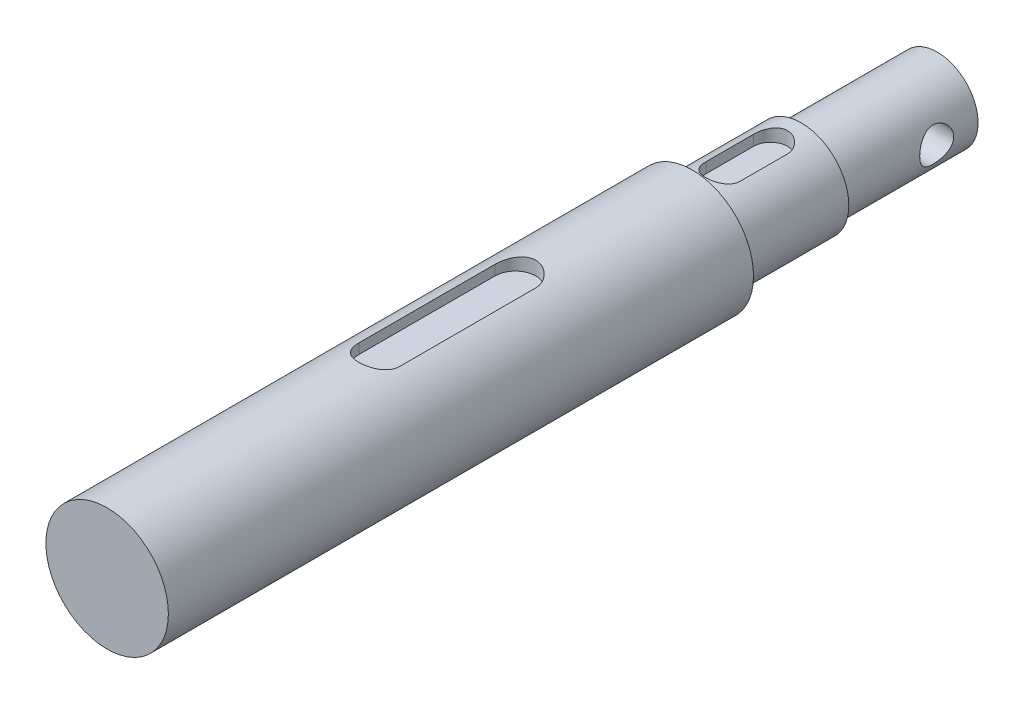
ISO-10303-21;
HEADER;
FILE_DESCRIPTION(('STEP AP214'),'2;1');
FILE_NAME('part.step','',(''),(''),'','','');
FILE_SCHEMA(('AUTOMOTIVE_DESIGN { 1 0 10303 214 1 1 1 1 }'));
ENDSEC;
DATA;
#1=APPLICATION_CONTEXT('core data for automotive mechanical design processes');
#2=APPLICATION_PROTOCOL_DEFINITION('international standard','automotive_design',2000,#1);
#3=PRODUCT_CONTEXT('',#1,'mechanical');
#4=PRODUCT('Part','Part','',(#3));
#5=PRODUCT_RELATED_PRODUCT_CATEGORY('part','',(#4));
#6=PRODUCT_DEFINITION_FORMATION('','',#4);
#7=PRODUCT_DEFINITION_CONTEXT('part definition',#1,'design');
#8=PRODUCT_DEFINITION('design','',#6,#7);
#9=PRODUCT_DEFINITION_SHAPE('','',#8);
#10=(LENGTH_UNIT() NAMED_UNIT(*) SI_UNIT(.MILLI.,.METRE.));
#11=(NAMED_UNIT(*) PLANE_ANGLE_UNIT() SI_UNIT($,.RADIAN.));
#12=(NAMED_UNIT(*) SI_UNIT($,.STERADIAN.) SOLID_ANGLE_UNIT());
#13=UNCERTAINTY_MEASURE_WITH_UNIT(LENGTH_MEASURE(1.E-05),#10,'distance_accuracy_value','');
#14=(GEOMETRIC_REPRESENTATION_CONTEXT(3) GLOBAL_UNCERTAINTY_ASSIGNED_CONTEXT((#13)) GLOBAL_UNIT_ASSIGNED_CONTEXT((#10,
#11,#12)) REPRESENTATION_CONTEXT('',''));
#15=CARTESIAN_POINT('',(0.,0.,0.));
#16=DIRECTION('',(0.,0.,1.));
#17=DIRECTION('',(1.,0.,0.));
#18=AXIS2_PLACEMENT_3D('',#15,#16,#17);
#19=CARTESIAN_POINT('',(-4.5,0.,-98.));
#20=DIRECTION('',(0.,0.,-1.));
#21=DIRECTION('',(-1.,0.,0.));
#22=AXIS2_PLACEMENT_3D('',#19,#20,#21);
#23=PLANE('',#22);
#24=CARTESIAN_POINT('',(-4.5,0.,-98.));
#25=DIRECTION('',(0.,0.,-1.));
#26=DIRECTION('',(-1.,0.,0.));
#27=AXIS2_PLACEMENT_3D('',#24,#25,#26);
#28=CIRCLE('',#27,7.);
#29=CARTESIAN_POINT('',(-11.5,0.,-98.));
#30=VERTEX_POINT('',#29);
#31=EDGE_CURVE('E158',#30,#30,#28,.T.);
#32=ORIENTED_EDGE('',*,*,#31,.T.);
#33=EDGE_LOOP('',(#32));
#34=FACE_BOUND('',#33,.T.);
#35=CARTESIAN_POINT('',(-4.5,0.,-98.));
#36=DIRECTION('',(0.,0.,-1.));
#37=DIRECTION('',(-1.,0.,0.));
#38=AXIS2_PLACEMENT_3D('',#35,#36,#37);
#39=CIRCLE('',#38,6.);
#40=CARTESIAN_POINT('',(-10.5,0.,-98.));
#41=VERTEX_POINT('',#40);
#42=EDGE_CURVE('E130',#41,#41,#39,.T.);
#43=ORIENTED_EDGE('',*,*,#42,.F.);
#44=EDGE_LOOP('',(#43));
#45=FACE_BOUND('',#44,.T.);
#46=ADVANCED_FACE('F31',(#34,#45),#23,.T.);
#47=CARTESIAN_POINT('',(-4.5,0.,-98.));
#48=DIRECTION('',(0.,0.,1.));
#49=DIRECTION('',(1.,0.,0.));
#50=AXIS2_PLACEMENT_3D('',#47,#48,#49);
#51=CYLINDRICAL_SURFACE('',#50,7.);
#52=CARTESIAN_POINT('',(-4.5,0.,-82.));
#53=DIRECTION('',(0.,0.,1.));
#54=DIRECTION('',(1.,0.,0.));
#55=AXIS2_PLACEMENT_3D('',#52,#53,#54);
#56=CIRCLE('',#55,7.);
#57=CARTESIAN_POINT('',(2.5,0.,-82.));
#58=VERTEX_POINT('',#57);
#59=EDGE_CURVE('E167',#58,#58,#56,.F.);
#60=ORIENTED_EDGE('',*,*,#59,.T.);
#61=EDGE_LOOP('',(#60));
#62=FACE_BOUND('',#61,.T.);
#63=ORIENTED_EDGE('',*,*,#31,.F.);
#64=EDGE_LOOP('',(#63));
#65=FACE_BOUND('',#64,.T.);
#66=CARTESIAN_POINT('',(-7.,6.53834841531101,-86.5));
#67=CARTESIAN_POINT('',(-7.00000932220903,6.53833653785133,-86.4321107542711));
#68=CARTESIAN_POINT('',(-6.99723485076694,6.53940549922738,-86.3642280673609));
#69=CARTESIAN_POINT('',(-6.9861910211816,6.54361657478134,-86.2289960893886));
#70=CARTESIAN_POINT('',(-6.97792334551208,6.54675805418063,-86.1616466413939));
#71=CARTESIAN_POINT('',(-6.95600175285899,6.55501217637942,-86.0281785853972));
#72=CARTESIAN_POINT('',(-6.94236559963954,6.56011831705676,-85.9620566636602));
#73=CARTESIAN_POINT('',(-6.90985115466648,6.57213177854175,-85.8312981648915));
#74=CARTESIAN_POINT('',(-6.89097263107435,6.57903917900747,-85.7666616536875));
#75=CARTESIAN_POINT('',(-6.82673964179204,6.6021493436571,-85.5757356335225));
#76=CARTESIAN_POINT('',(-6.77375112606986,6.62075475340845,-85.4522095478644));
#77=CARTESIAN_POINT('',(-6.64910757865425,6.6622539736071,-85.215769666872));
#78=CARTESIAN_POINT('',(-6.57743895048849,6.68515090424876,-85.1028636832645));
#79=CARTESIAN_POINT('',(-6.4140257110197,6.73379913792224,-84.8857847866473));
#80=CARTESIAN_POINT('',(-6.32158337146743,6.75962864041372,-84.7821535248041));
#81=CARTESIAN_POINT('',(-6.12073388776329,6.81057592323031,-84.5914912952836));
#82=CARTESIAN_POINT('',(-6.01232377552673,6.83569357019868,-84.5044634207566));
#83=CARTESIAN_POINT('',(-5.77853915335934,6.88331133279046,-84.346910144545));
#84=CARTESIAN_POINT('',(-5.65274833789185,6.90570835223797,-84.2769684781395));
#85=CARTESIAN_POINT('',(-5.39025082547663,6.94442357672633,-84.1594633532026));
#86=CARTESIAN_POINT('',(-5.25354789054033,6.96074386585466,-84.111892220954));
#87=CARTESIAN_POINT('',(-4.97882997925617,6.98491050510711,-84.0423593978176));
#88=CARTESIAN_POINT('',(-4.84107983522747,6.99306594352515,-84.0194608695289));
#89=CARTESIAN_POINT('',(-4.5634643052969,7.00108798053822,-83.9969315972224));
#90=CARTESIAN_POINT('',(-4.42359951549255,7.00095687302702,-83.9972944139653));
#91=CARTESIAN_POINT('',(-4.15240674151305,6.99262258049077,-84.0207112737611));
#92=CARTESIAN_POINT('',(-4.02097759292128,6.98478243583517,-84.0427447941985));
#93=CARTESIAN_POINT('',(-3.76382418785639,6.96237832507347,-84.1071734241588));
#94=CARTESIAN_POINT('',(-3.63810025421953,6.94781397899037,-84.1495696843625));
#95=CARTESIAN_POINT('',(-3.39383897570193,6.91316506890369,-84.2540469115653));
#96=CARTESIAN_POINT('',(-3.27542720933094,6.89300592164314,-84.3163957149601));
#97=CARTESIAN_POINT('',(-3.05046468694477,6.84923355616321,-84.4587793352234));
#98=CARTESIAN_POINT('',(-2.9439175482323,6.82561928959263,-84.5388195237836));
#99=CARTESIAN_POINT('',(-2.7396755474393,6.7759054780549,-84.7193232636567));
#100=CARTESIAN_POINT('',(-2.64275814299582,6.74974055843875,-84.8206497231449));
#101=CARTESIAN_POINT('',(-2.46700085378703,6.69890342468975,-85.0383273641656));
#102=CARTESIAN_POINT('',(-2.38816744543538,6.67423174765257,-85.1546839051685));
#103=CARTESIAN_POINT('',(-2.24950139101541,6.62877803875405,-85.401942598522));
#104=CARTESIAN_POINT('',(-2.19005792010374,6.60807875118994,-85.5330789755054));
#105=CARTESIAN_POINT('',(-2.0944456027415,6.57388213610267,-85.8043648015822));
#106=CARTESIAN_POINT('',(-2.05823880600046,6.56037307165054,-85.944499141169));
#107=CARTESIAN_POINT('',(-2.02294502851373,6.54708542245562,-86.1550305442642));
#108=CARTESIAN_POINT('',(-2.01434652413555,6.54382010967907,-86.2237363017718));
#109=CARTESIAN_POINT('',(-2.00287647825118,6.53944910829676,-86.3616151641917));
#110=CARTESIAN_POINT('',(-1.99999860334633,6.53834103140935,-86.4307876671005));
#111=CARTESIAN_POINT('',(-2.,6.53834841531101,-86.5));
#112=B_SPLINE_CURVE_WITH_KNOTS('',3,(#66,#67,#68,#69,#70,#71,#72,#73,#74,#75,#76,#77,#78,#79,
#80,#81,#82,#83,#84,#85,#86,#87,#88,#89,#90,#91,#92,#93,#94,#95,#96,#97,#98,#99,#100,#101,#102,
#103,#104,#105,#106,#107,#108,#109,#110,#111),.UNSPECIFIED.,.F.,.F.,(4,2,2,2,2,2,2,2,2,2,2,2,2,
2,2,2,2,2,2,2,2,2,4),(0.,0.203591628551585,0.407120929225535,0.609982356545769,
0.812852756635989,1.21793118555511,1.6233052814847,2.04515972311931,2.4670926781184,
2.90188398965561,3.33652604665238,3.75400993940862,4.17137826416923,4.56998920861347,
4.96862268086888,5.3728490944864,5.77719841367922,6.20315837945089,6.62927065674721,
7.06347329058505,7.49696496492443,7.70468580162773,7.91217653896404),.UNSPECIFIED.);
#113=CARTESIAN_POINT('',(-7.,6.53834841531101,-86.5));
#114=VERTEX_POINT('',#113);
#115=CARTESIAN_POINT('',(-2.,6.53834841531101,-86.5));
#116=VERTEX_POINT('',#115);
#117=EDGE_CURVE('E11',#114,#116,#112,.T.);
#118=ORIENTED_EDGE('',*,*,#117,.F.);
#119=DIRECTION('',(0.,0.,1.));
#120=VECTOR('',#119,1.);
#121=CARTESIAN_POINT('',(-7.,6.53834841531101,-98.));
#122=LINE('',#121,#120);
#123=CARTESIAN_POINT('',(-7.,6.53834841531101,-93.5));
#124=VERTEX_POINT('',#123);
#125=EDGE_CURVE('E245',#124,#114,#122,.T.);
#126=ORIENTED_EDGE('',*,*,#125,.F.);
#127=CARTESIAN_POINT('',(-2.,6.53834841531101,-93.5));
#128=CARTESIAN_POINT('',(-1.99999067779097,6.53833653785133,-93.5678892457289));
#129=CARTESIAN_POINT('',(-2.00276514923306,6.53940549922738,-93.6357719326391));
#130=CARTESIAN_POINT('',(-2.0138089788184,6.54361657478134,-93.7710039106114));
#131=CARTESIAN_POINT('',(-2.02207665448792,6.54675805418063,-93.8383533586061));
#132=CARTESIAN_POINT('',(-2.043998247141,6.55501217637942,-93.9718214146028));
#133=CARTESIAN_POINT('',(-2.05763440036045,6.56011831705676,-94.0379433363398));
#134=CARTESIAN_POINT('',(-2.09014884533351,6.57213177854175,-94.1687018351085));
#135=CARTESIAN_POINT('',(-2.10902736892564,6.57903917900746,-94.2333383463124));
#136=CARTESIAN_POINT('',(-2.17326035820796,6.6021493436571,-94.4242643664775));
#137=CARTESIAN_POINT('',(-2.22624887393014,6.62075475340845,-94.5477904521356));
#138=CARTESIAN_POINT('',(-2.35089242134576,6.6622539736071,-94.784230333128));
#139=CARTESIAN_POINT('',(-2.42256104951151,6.68515090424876,-94.8971363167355));
#140=CARTESIAN_POINT('',(-2.5859742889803,6.73379913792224,-95.1142152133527));
#141=CARTESIAN_POINT('',(-2.67841662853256,6.75962864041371,-95.2178464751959));
#142=CARTESIAN_POINT('',(-2.8792661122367,6.81057592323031,-95.4085087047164));
#143=CARTESIAN_POINT('',(-2.98767622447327,6.83569357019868,-95.4955365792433));
#144=CARTESIAN_POINT('',(-3.22146084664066,6.88331133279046,-95.653089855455));
#145=CARTESIAN_POINT('',(-3.34725166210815,6.90570835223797,-95.7230315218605));
#146=CARTESIAN_POINT('',(-3.60974917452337,6.94442357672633,-95.8405366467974));
#147=CARTESIAN_POINT('',(-3.74645210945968,6.96074386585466,-95.888107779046));
#148=CARTESIAN_POINT('',(-4.02117002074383,6.98491050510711,-95.9576406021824));
#149=CARTESIAN_POINT('',(-4.15892016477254,6.99306594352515,-95.9805391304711));
#150=CARTESIAN_POINT('',(-4.4365356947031,7.00108798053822,-96.0030684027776));
#151=CARTESIAN_POINT('',(-4.57640048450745,7.00095687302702,-96.0027055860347));
#152=CARTESIAN_POINT('',(-4.84759325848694,6.99262258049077,-95.9792887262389));
#153=CARTESIAN_POINT('',(-4.97902240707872,6.98478243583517,-95.9572552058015));
#154=CARTESIAN_POINT('',(-5.2361758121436,6.96237832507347,-95.8928265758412));
#155=CARTESIAN_POINT('',(-5.36189974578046,6.94781397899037,-95.8504303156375));
#156=CARTESIAN_POINT('',(-5.60616102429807,6.91316506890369,-95.7459530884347));
#157=CARTESIAN_POINT('',(-5.72457279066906,6.89300592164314,-95.6836042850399));
#158=CARTESIAN_POINT('',(-5.94953531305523,6.84923355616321,-95.5412206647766));
#159=CARTESIAN_POINT('',(-6.0560824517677,6.82561928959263,-95.4611804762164));
#160=CARTESIAN_POINT('',(-6.2603244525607,6.7759054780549,-95.2806767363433));
#161=CARTESIAN_POINT('',(-6.35724185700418,6.74974055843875,-95.1793502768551));
#162=CARTESIAN_POINT('',(-6.53299914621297,6.69890342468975,-94.9616726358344));
#163=CARTESIAN_POINT('',(-6.61183255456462,6.67423174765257,-94.8453160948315));
#164=CARTESIAN_POINT('',(-6.75049860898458,6.62877803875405,-94.598057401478));
#165=CARTESIAN_POINT('',(-6.80994207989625,6.60807875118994,-94.4669210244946));
#166=CARTESIAN_POINT('',(-6.90555439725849,6.57388213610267,-94.1956351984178));
#167=CARTESIAN_POINT('',(-6.94176119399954,6.56037307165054,-94.055500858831));
#168=CARTESIAN_POINT('',(-6.97705497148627,6.54708542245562,-93.8449694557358));
#169=CARTESIAN_POINT('',(-6.98565347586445,6.54382010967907,-93.7762636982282));
#170=CARTESIAN_POINT('',(-6.99712352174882,6.53944910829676,-93.6383848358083));
#171=CARTESIAN_POINT('',(-7.00000139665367,6.53834103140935,-93.5692123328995));
#172=CARTESIAN_POINT('',(-7.,6.53834841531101,-93.5));
#173=B_SPLINE_CURVE_WITH_KNOTS('',3,(#127,#128,#129,#130,#131,#132,#133,#134,#135,#136,#137,
#138,#139,#140,#141,#142,#143,#144,#145,#146,#147,#148,#149,#150,#151,#152,#153,#154,#155,#156,
#157,#158,#159,#160,#161,#162,#163,#164,#165,#166,#167,#168,#169,#170,#171,#172),.UNSPECIFIED.,
.F.,.F.,(4,2,2,2,2,2,2,2,2,2,2,2,2,2,2,2,2,2,2,2,2,2,4),(0.,0.203591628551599,0.407120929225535,
0.609982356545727,0.812852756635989,1.21793118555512,1.6233052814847,2.0451597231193,
2.4670926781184,2.90188398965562,3.33652604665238,3.75400993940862,4.17137826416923,
4.56998920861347,4.96862268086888,5.3728490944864,5.77719841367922,6.20315837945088,
6.62927065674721,7.06347329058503,7.49696496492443,7.70468580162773,7.91217653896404),.UNSPECIFIED.);
#174=CARTESIAN_POINT('',(-2.,6.53834841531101,-93.5));
#175=VERTEX_POINT('',#174);
#176=EDGE_CURVE('E210',#175,#124,#173,.T.);
#177=ORIENTED_EDGE('',*,*,#176,.F.);
#178=DIRECTION('',(0.,0.,1.));
#179=VECTOR('',#178,1.);
#180=CARTESIAN_POINT('',(-2.,6.53834841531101,-98.));
#181=LINE('',#180,#179);
#182=EDGE_CURVE('E45',#116,#175,#181,.F.);
#183=ORIENTED_EDGE('',*,*,#182,.F.);
#184=EDGE_LOOP('',(#118,#126,#177,#183));
#185=FACE_BOUND('',#184,.T.);
#186=ADVANCED_FACE('F201',(#62,#65,#185),#51,.T.);
#187=CARTESIAN_POINT('',(-4.5,0.,4.));
#188=DIRECTION('',(0.,0.,-1.));
#189=DIRECTION('',(-1.,0.,0.));
#190=AXIS2_PLACEMENT_3D('',#187,#188,#189);
#191=CYLINDRICAL_SURFACE('',#190,9.);
#192=CARTESIAN_POINT('',(-4.5,0.,4.));
#193=DIRECTION('',(0.,0.,1.));
#194=DIRECTION('',(1.,0.,0.));
#195=AXIS2_PLACEMENT_3D('',#192,#193,#194);
#196=CIRCLE('',#195,9.);
#197=CARTESIAN_POINT('',(4.5,0.,4.));
#198=VERTEX_POINT('',#197);
#199=EDGE_CURVE('E164',#198,#198,#196,.T.);
#200=ORIENTED_EDGE('',*,*,#199,.F.);
#201=EDGE_LOOP('',(#200));
#202=FACE_BOUND('',#201,.T.);
#203=CARTESIAN_POINT('',(-4.5,0.,-82.));
#204=DIRECTION('',(0.,0.,1.));
#205=DIRECTION('',(1.,0.,0.));
#206=AXIS2_PLACEMENT_3D('',#203,#204,#205);
#207=CIRCLE('',#206,9.);
#208=CARTESIAN_POINT('',(4.5,0.,-82.));
#209=VERTEX_POINT('',#208);
#210=EDGE_CURVE('E161',#209,#209,#207,.T.);
#211=ORIENTED_EDGE('',*,*,#210,.T.);
#212=EDGE_LOOP('',(#211));
#213=FACE_BOUND('',#212,.T.);
#214=CARTESIAN_POINT('',(-1.5,8.48528137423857,-56.));
#215=CARTESIAN_POINT('',(-1.49998921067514,8.48526831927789,-56.0818484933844));
#216=CARTESIAN_POINT('',(-1.50334935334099,8.48646532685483,-56.1636896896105));
#217=CARTESIAN_POINT('',(-1.51672745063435,8.49118228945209,-56.3267372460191));
#218=CARTESIAN_POINT('',(-1.52674360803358,8.49470161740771,-56.4079437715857));
#219=CARTESIAN_POINT('',(-1.55331048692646,8.50395246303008,-56.5689085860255));
#220=CARTESIAN_POINT('',(-1.56984182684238,8.50967741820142,-56.648670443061));
#221=CARTESIAN_POINT('',(-1.60926982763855,8.52315143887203,-56.8064099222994));
#222=CARTESIAN_POINT('',(-1.63216671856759,8.53090057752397,-56.884387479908));
#223=CARTESIAN_POINT('',(-1.7101013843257,8.55683928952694,-57.1147538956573));
#224=CARTESIAN_POINT('',(-1.77442299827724,8.57773492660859,-57.2638149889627));
#225=CARTESIAN_POINT('',(-1.9257865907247,8.62436440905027,-57.5490521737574));
#226=CARTESIAN_POINT('',(-2.0128425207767,8.65010122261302,-57.6852202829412));
#227=CARTESIAN_POINT('',(-2.21084404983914,8.70463418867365,-57.9461514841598));
#228=CARTESIAN_POINT('',(-2.32252458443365,8.73350627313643,-58.0703421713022));
#229=CARTESIAN_POINT('',(-2.56503514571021,8.79041552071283,-58.2986205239));
#230=CARTESIAN_POINT('',(-2.69586857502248,8.81845253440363,-58.402704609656));
#231=CARTESIAN_POINT('',(-2.97718893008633,8.87141647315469,-58.5904378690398));
#232=CARTESIAN_POINT('',(-3.12809969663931,8.8962431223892,-58.6734827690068));
#233=CARTESIAN_POINT('',(-3.44271228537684,8.9390882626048,-58.8127769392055));
#234=CARTESIAN_POINT('',(-3.60641018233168,8.95710883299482,-58.8690343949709));
#235=CARTESIAN_POINT('',(-3.93591195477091,8.98377213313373,-58.9512071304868));
#236=CARTESIAN_POINT('',(-4.10144449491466,8.99271926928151,-58.9781098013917));
#237=CARTESIAN_POINT('',(-4.43490309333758,9.0013082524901,-59.0039489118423));
#238=CARTESIAN_POINT('',(-4.60282857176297,9.00095231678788,-59.0028920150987));
#239=CARTESIAN_POINT('',(-4.92931153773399,8.99118115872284,-58.9734671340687));
#240=CARTESIAN_POINT('',(-5.08797811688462,8.98212182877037,-58.9461720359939));
#241=CARTESIAN_POINT('',(-5.39833218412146,8.9564088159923,-58.8668204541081));
#242=CARTESIAN_POINT('',(-5.55001928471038,8.93975471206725,-58.8147625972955));
#243=CARTESIAN_POINT('',(-5.84445790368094,8.90027004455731,-58.6867357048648));
#244=CARTESIAN_POINT('',(-5.98706564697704,8.87736112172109,-58.6104611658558));
#245=CARTESIAN_POINT('',(-6.25777363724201,8.82775164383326,-58.4364208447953));
#246=CARTESIAN_POINT('',(-6.38586992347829,8.80105005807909,-58.3386492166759));
#247=CARTESIAN_POINT('',(-6.63029252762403,8.74518810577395,-58.1189841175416));
#248=CARTESIAN_POINT('',(-6.74578277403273,8.71597116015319,-57.9961729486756));
#249=CARTESIAN_POINT('',(-6.95481413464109,8.65942491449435,-57.7326859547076));
#250=CARTESIAN_POINT('',(-7.04834815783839,8.63209622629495,-57.5920043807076));
#251=CARTESIAN_POINT('',(-7.21201733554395,8.58210018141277,-57.2939199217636));
#252=CARTESIAN_POINT('',(-7.28178668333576,8.55950759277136,-57.1363008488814));
#253=CARTESIAN_POINT('',(-7.36551808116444,8.5316849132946,-56.8923158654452));
#254=CARTESIAN_POINT('',(-7.389939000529,8.52342263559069,-56.8097432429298));
#255=CARTESIAN_POINT('',(-7.43162549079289,8.50917513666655,-56.6426296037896));
#256=CARTESIAN_POINT('',(-7.44889432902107,8.50318887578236,-56.5580895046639));
#257=CARTESIAN_POINT('',(-7.47496555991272,8.49410161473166,-56.3947667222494));
#258=CARTESIAN_POINT('',(-7.48435073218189,8.49080270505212,-56.3160871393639));
#259=CARTESIAN_POINT('',(-7.49686829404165,8.48638843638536,-56.1582744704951));
#260=CARTESIAN_POINT('',(-7.50000875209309,8.48527025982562,-56.0791421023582));
#261=CARTESIAN_POINT('',(-7.5,8.48528137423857,-56.));
#262=B_SPLINE_CURVE_WITH_KNOTS('',3,(#214,#215,#216,#217,#218,#219,#220,#221,#222,#223,#224,
#225,#226,#227,#228,#229,#230,#231,#232,#233,#234,#235,#236,#237,#238,#239,#240,#241,#242,#243,
#244,#245,#246,#247,#248,#249,#250,#251,#252,#253,#254,#255,#256,#257,#258,#259,#260,#261),
.UNSPECIFIED.,.F.,.F.,(4,2,2,2,2,2,2,2,2,2,2,2,2,2,2,2,2,2,2,2,2,2,2,4),(0.,0.245455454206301,
0.490844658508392,0.735509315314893,0.980182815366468,1.46881220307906,1.95774215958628,
2.46393436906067,2.97021661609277,3.48971320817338,4.00905095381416,4.51032334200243,
5.01147626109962,5.4929717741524,5.97449398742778,6.46234978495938,6.95033841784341,
7.46126084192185,7.97234804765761,8.49098011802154,8.75020549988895,9.00931232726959,
9.24695816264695,9.48429674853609),.UNSPECIFIED.);
#263=CARTESIAN_POINT('',(-1.5,8.48528137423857,-56.));
#264=VERTEX_POINT('',#263);
#265=CARTESIAN_POINT('',(-7.5,8.48528137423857,-56.));
#266=VERTEX_POINT('',#265);
#267=EDGE_CURVE('E170',#264,#266,#262,.T.);
#268=ORIENTED_EDGE('',*,*,#267,.F.);
#269=DIRECTION('',(0.,0.,-1.));
#270=VECTOR('',#269,1.);
#271=CARTESIAN_POINT('',(-1.5,8.48528137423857,4.));
#272=LINE('',#271,#270);
#273=CARTESIAN_POINT('',(-1.5,8.48528137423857,-36.));
#274=VERTEX_POINT('',#273);
#275=EDGE_CURVE('E241',#274,#264,#272,.T.);
#276=ORIENTED_EDGE('',*,*,#275,.F.);
#277=CARTESIAN_POINT('',(-7.5,8.48528137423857,-36.));
#278=CARTESIAN_POINT('',(-7.50001078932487,8.48526831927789,-35.9181515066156));
#279=CARTESIAN_POINT('',(-7.49665064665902,8.48646532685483,-35.8363103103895));
#280=CARTESIAN_POINT('',(-7.48327254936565,8.49118228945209,-35.6732627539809));
#281=CARTESIAN_POINT('',(-7.47325639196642,8.49470161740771,-35.5920562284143));
#282=CARTESIAN_POINT('',(-7.44668951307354,8.50395246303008,-35.4310914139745));
#283=CARTESIAN_POINT('',(-7.43015817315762,8.50967741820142,-35.351329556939));
#284=CARTESIAN_POINT('',(-7.39073017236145,8.52315143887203,-35.1935900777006));
#285=CARTESIAN_POINT('',(-7.36783328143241,8.53090057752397,-35.115612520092));
#286=CARTESIAN_POINT('',(-7.2898986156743,8.55683928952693,-34.8852461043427));
#287=CARTESIAN_POINT('',(-7.22557700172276,8.57773492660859,-34.7361850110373));
#288=CARTESIAN_POINT('',(-7.0742134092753,8.62436440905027,-34.4509478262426));
#289=CARTESIAN_POINT('',(-6.98715747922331,8.65010122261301,-34.3147797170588));
#290=CARTESIAN_POINT('',(-6.78915595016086,8.70463418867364,-34.0538485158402));
#291=CARTESIAN_POINT('',(-6.67747541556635,8.73350627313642,-33.9296578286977));
#292=CARTESIAN_POINT('',(-6.43496485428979,8.79041552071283,-33.7013794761));
#293=CARTESIAN_POINT('',(-6.30413142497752,8.81845253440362,-33.597295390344));
#294=CARTESIAN_POINT('',(-6.02281106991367,8.87141647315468,-33.4095621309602));
#295=CARTESIAN_POINT('',(-5.87190030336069,8.8962431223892,-33.3265172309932));
#296=CARTESIAN_POINT('',(-5.55728771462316,8.9390882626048,-33.1872230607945));
#297=CARTESIAN_POINT('',(-5.39358981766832,8.95710883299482,-33.1309656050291));
#298=CARTESIAN_POINT('',(-5.06408804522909,8.98377213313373,-33.0487928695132));
#299=CARTESIAN_POINT('',(-4.89855550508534,8.99271926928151,-33.0218901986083));
#300=CARTESIAN_POINT('',(-4.56509690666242,9.0013082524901,-32.9960510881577));
#301=CARTESIAN_POINT('',(-4.39717142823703,9.00095231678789,-32.9971079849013));
#302=CARTESIAN_POINT('',(-4.07068846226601,8.99118115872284,-33.0265328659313));
#303=CARTESIAN_POINT('',(-3.91202188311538,8.98212182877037,-33.0538279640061));
#304=CARTESIAN_POINT('',(-3.60166781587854,8.9564088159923,-33.1331795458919));
#305=CARTESIAN_POINT('',(-3.44998071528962,8.93975471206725,-33.1852374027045));
#306=CARTESIAN_POINT('',(-3.15554209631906,8.90027004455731,-33.3132642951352));
#307=CARTESIAN_POINT('',(-3.01293435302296,8.87736112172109,-33.3895388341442));
#308=CARTESIAN_POINT('',(-2.74222636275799,8.82775164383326,-33.5635791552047));
#309=CARTESIAN_POINT('',(-2.61413007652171,8.80105005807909,-33.6613507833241));
#310=CARTESIAN_POINT('',(-2.36970747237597,8.74518810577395,-33.8810158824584));
#311=CARTESIAN_POINT('',(-2.25421722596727,8.71597116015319,-34.0038270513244));
#312=CARTESIAN_POINT('',(-2.04518586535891,8.65942491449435,-34.2673140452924));
#313=CARTESIAN_POINT('',(-1.95165184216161,8.63209622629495,-34.4079956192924));
#314=CARTESIAN_POINT('',(-1.78798266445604,8.58210018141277,-34.7060800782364));
#315=CARTESIAN_POINT('',(-1.71821331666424,8.55950759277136,-34.8636991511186));
#316=CARTESIAN_POINT('',(-1.63448191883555,8.5316849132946,-35.1076841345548));
#317=CARTESIAN_POINT('',(-1.610060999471,8.52342263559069,-35.1902567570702));
#318=CARTESIAN_POINT('',(-1.56837450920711,8.50917513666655,-35.3573703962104));
#319=CARTESIAN_POINT('',(-1.55110567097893,8.50318887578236,-35.4419104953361));
#320=CARTESIAN_POINT('',(-1.52503444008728,8.49410161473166,-35.6052332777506));
#321=CARTESIAN_POINT('',(-1.51564926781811,8.49080270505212,-35.6839128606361));
#322=CARTESIAN_POINT('',(-1.50313170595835,8.48638843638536,-35.8417255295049));
#323=CARTESIAN_POINT('',(-1.49999124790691,8.48527025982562,-35.9208578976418));
#324=CARTESIAN_POINT('',(-1.5,8.48528137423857,-36.));
#325=B_SPLINE_CURVE_WITH_KNOTS('',3,(#277,#278,#279,#280,#281,#282,#283,#284,#285,#286,#287,
#288,#289,#290,#291,#292,#293,#294,#295,#296,#297,#298,#299,#300,#301,#302,#303,#304,#305,#306,
#307,#308,#309,#310,#311,#312,#313,#314,#315,#316,#317,#318,#319,#320,#321,#322,#323,#324),
.UNSPECIFIED.,.F.,.F.,(4,2,2,2,2,2,2,2,2,2,2,2,2,2,2,2,2,2,2,2,2,2,2,4),(0.,0.245455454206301,
0.490844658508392,0.735509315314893,0.980182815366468,1.46881220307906,1.95774215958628,
2.46393436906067,2.97021661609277,3.48971320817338,4.00905095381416,4.51032334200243,
5.01147626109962,5.4929717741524,5.97449398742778,6.46234978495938,6.9503384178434,
7.46126084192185,7.97234804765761,8.49098011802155,8.75020549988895,9.00931232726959,
9.24695816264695,9.48429674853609),.UNSPECIFIED.);
#326=CARTESIAN_POINT('',(-7.5,8.48528137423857,-36.));
#327=VERTEX_POINT('',#326);
#328=EDGE_CURVE('E176',#327,#274,#325,.T.);
#329=ORIENTED_EDGE('',*,*,#328,.F.);
#330=DIRECTION('',(0.,0.,-1.));
#331=VECTOR('',#330,1.);
#332=CARTESIAN_POINT('',(-7.5,8.48528137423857,4.));
#333=LINE('',#332,#331);
#334=EDGE_CURVE('E243',#266,#327,#333,.F.);
#335=ORIENTED_EDGE('',*,*,#334,.F.);
#336=EDGE_LOOP('',(#268,#276,#329,#335));
#337=FACE_BOUND('',#336,.T.);
#338=ADVANCED_FACE('F33',(#202,#213,#337),#191,.T.);
#339=CARTESIAN_POINT('',(-4.5,0.,-82.));
#340=DIRECTION('',(0.,0.,1.));
#341=DIRECTION('',(1.,0.,0.));
#342=AXIS2_PLACEMENT_3D('',#339,#340,#341);
#343=PLANE('',#342);
#344=ORIENTED_EDGE('',*,*,#210,.F.);
#345=EDGE_LOOP('',(#344));
#346=FACE_BOUND('',#345,.T.);
#347=ORIENTED_EDGE('',*,*,#59,.F.);
#348=EDGE_LOOP('',(#347));
#349=FACE_BOUND('',#348,.T.);
#350=ADVANCED_FACE('F207',(#346,#349),#343,.F.);
#351=CARTESIAN_POINT('',(-4.5,0.,4.));
#352=DIRECTION('',(0.,0.,1.));
#353=DIRECTION('',(1.,0.,0.));
#354=AXIS2_PLACEMENT_3D('',#351,#352,#353);
#355=PLANE('',#354);
#356=ORIENTED_EDGE('',*,*,#199,.T.);
#357=EDGE_LOOP('',(#356));
#358=FACE_BOUND('',#357,.T.);
#359=ADVANCED_FACE('F197',(#358),#355,.T.);
#360=CARTESIAN_POINT('',(-4.5,9.,-36.));
#361=DIRECTION('',(0.,-1.,0.));
#362=DIRECTION('',(0.,0.,-1.));
#363=AXIS2_PLACEMENT_3D('',#360,#361,#362);
#364=CYLINDRICAL_SURFACE('',#363,3.);
#365=DIRECTION('',(0.,-1.,0.));
#366=VECTOR('',#365,1.);
#367=CARTESIAN_POINT('',(-7.5,9.,-36.));
#368=LINE('',#367,#366);
#369=CARTESIAN_POINT('',(-7.5,7.,-36.));
#370=VERTEX_POINT('',#369);
#371=EDGE_CURVE('E151',#327,#370,#368,.T.);
#372=ORIENTED_EDGE('',*,*,#371,.F.);
#373=ORIENTED_EDGE('',*,*,#328,.T.);
#374=DIRECTION('',(0.,-1.,0.));
#375=VECTOR('',#374,1.);
#376=CARTESIAN_POINT('',(-1.5,9.,-36.));
#377=LINE('',#376,#375);
#378=CARTESIAN_POINT('',(-1.5,7.,-36.));
#379=VERTEX_POINT('',#378);
#380=EDGE_CURVE('E156',#274,#379,#377,.T.);
#381=ORIENTED_EDGE('',*,*,#380,.T.);
#382=CARTESIAN_POINT('',(-4.5,7.,-36.));
#383=DIRECTION('',(0.,1.,0.));
#384=DIRECTION('',(0.,0.,1.));
#385=AXIS2_PLACEMENT_3D('',#382,#383,#384);
#386=CIRCLE('',#385,3.);
#387=EDGE_CURVE('E112',#370,#379,#386,.T.);
#388=ORIENTED_EDGE('',*,*,#387,.F.);
#389=EDGE_LOOP('',(#372,#373,#381,#388));
#390=FACE_BOUND('',#389,.T.);
#391=ADVANCED_FACE('F192',(#390),#364,.F.);
#392=CARTESIAN_POINT('',(-1.5,9.,-36.));
#393=DIRECTION('',(-1.,0.,0.));
#394=DIRECTION('',(0.,0.,1.));
#395=AXIS2_PLACEMENT_3D('',#392,#393,#394);
#396=PLANE('',#395);
#397=ORIENTED_EDGE('',*,*,#275,.T.);
#398=DIRECTION('',(0.,-1.,0.));
#399=VECTOR('',#398,1.);
#400=CARTESIAN_POINT('',(-1.5,9.,-56.));
#401=LINE('',#400,#399);
#402=CARTESIAN_POINT('',(-1.5,7.,-56.));
#403=VERTEX_POINT('',#402);
#404=EDGE_CURVE('E154',#264,#403,#401,.T.);
#405=ORIENTED_EDGE('',*,*,#404,.T.);
#406=DIRECTION('',(0.,0.,-1.));
#407=VECTOR('',#406,1.);
#408=CARTESIAN_POINT('',(-1.5,7.,-36.));
#409=LINE('',#408,#407);
#410=EDGE_CURVE('E142',#379,#403,#409,.T.);
#411=ORIENTED_EDGE('',*,*,#410,.F.);
#412=ORIENTED_EDGE('',*,*,#380,.F.);
#413=EDGE_LOOP('',(#397,#405,#411,#412));
#414=FACE_BOUND('',#413,.T.);
#415=ADVANCED_FACE('F188',(#414),#396,.T.);
#416=CARTESIAN_POINT('',(-4.5,9.,-56.));
#417=DIRECTION('',(0.,-1.,0.));
#418=DIRECTION('',(0.,0.,-1.));
#419=AXIS2_PLACEMENT_3D('',#416,#417,#418);
#420=CYLINDRICAL_SURFACE('',#419,3.);
#421=ORIENTED_EDGE('',*,*,#404,.F.);
#422=ORIENTED_EDGE('',*,*,#267,.T.);
#423=DIRECTION('',(0.,-1.,0.));
#424=VECTOR('',#423,1.);
#425=CARTESIAN_POINT('',(-7.5,9.,-56.));
#426=LINE('',#425,#424);
#427=CARTESIAN_POINT('',(-7.5,7.,-56.));
#428=VERTEX_POINT('',#427);
#429=EDGE_CURVE('E61',#266,#428,#426,.T.);
#430=ORIENTED_EDGE('',*,*,#429,.T.);
#431=CARTESIAN_POINT('',(-4.5,7.,-56.));
#432=DIRECTION('',(0.,1.,0.));
#433=DIRECTION('',(0.,0.,1.));
#434=AXIS2_PLACEMENT_3D('',#431,#432,#433);
#435=CIRCLE('',#434,3.);
#436=EDGE_CURVE('E145',#403,#428,#435,.T.);
#437=ORIENTED_EDGE('',*,*,#436,.F.);
#438=EDGE_LOOP('',(#421,#422,#430,#437));
#439=FACE_BOUND('',#438,.T.);
#440=ADVANCED_FACE('F182',(#439),#420,.F.);
#441=CARTESIAN_POINT('',(-7.5,9.,-56.));
#442=DIRECTION('',(1.,0.,0.));
#443=DIRECTION('',(0.,0.,-1.));
#444=AXIS2_PLACEMENT_3D('',#441,#442,#443);
#445=PLANE('',#444);
#446=ORIENTED_EDGE('',*,*,#334,.T.);
#447=ORIENTED_EDGE('',*,*,#371,.T.);
#448=DIRECTION('',(0.,0.,1.));
#449=VECTOR('',#448,1.);
#450=CARTESIAN_POINT('',(-7.5,7.,-56.));
#451=LINE('',#450,#449);
#452=EDGE_CURVE('E148',#428,#370,#451,.T.);
#453=ORIENTED_EDGE('',*,*,#452,.F.);
#454=ORIENTED_EDGE('',*,*,#429,.F.);
#455=EDGE_LOOP('',(#446,#447,#453,#454));
#456=FACE_BOUND('',#455,.T.);
#457=ADVANCED_FACE('F187',(#456),#445,.T.);
#458=CARTESIAN_POINT('',(-4.5,7.,-36.));
#459=DIRECTION('',(0.,1.,0.));
#460=DIRECTION('',(0.,0.,1.));
#461=AXIS2_PLACEMENT_3D('',#458,#459,#460);
#462=PLANE('',#461);
#463=ORIENTED_EDGE('',*,*,#387,.T.);
#464=ORIENTED_EDGE('',*,*,#410,.T.);
#465=ORIENTED_EDGE('',*,*,#436,.T.);
#466=ORIENTED_EDGE('',*,*,#452,.T.);
#467=EDGE_LOOP('',(#463,#464,#465,#466));
#468=FACE_BOUND('',#467,.T.);
#469=ADVANCED_FACE('F227',(#468),#462,.T.);
#470=CARTESIAN_POINT('',(-4.5,9.,-86.5));
#471=DIRECTION('',(0.,-1.,0.));
#472=DIRECTION('',(0.,0.,-1.));
#473=AXIS2_PLACEMENT_3D('',#470,#471,#472);
#474=CYLINDRICAL_SURFACE('',#473,2.5);
#475=ORIENTED_EDGE('',*,*,#117,.T.);
#476=DIRECTION('',(0.,-1.,0.));
#477=VECTOR('',#476,1.);
#478=CARTESIAN_POINT('',(-2.,9.,-86.5));
#479=LINE('',#478,#477);
#480=CARTESIAN_POINT('',(-2.,5.,-86.5));
#481=VERTEX_POINT('',#480);
#482=EDGE_CURVE('E103',#116,#481,#479,.T.);
#483=ORIENTED_EDGE('',*,*,#482,.T.);
#484=CARTESIAN_POINT('',(-4.5,5.,-86.5));
#485=DIRECTION('',(0.,1.,0.));
#486=DIRECTION('',(0.,0.,-1.));
#487=AXIS2_PLACEMENT_3D('',#484,#485,#486);
#488=CIRCLE('',#487,2.5);
#489=CARTESIAN_POINT('',(-7.,5.,-86.5));
#490=VERTEX_POINT('',#489);
#491=EDGE_CURVE('E108',#490,#481,#488,.T.);
#492=ORIENTED_EDGE('',*,*,#491,.F.);
#493=DIRECTION('',(0.,-1.,0.));
#494=VECTOR('',#493,1.);
#495=CARTESIAN_POINT('',(-7.,9.,-86.5));
#496=LINE('',#495,#494);
#497=EDGE_CURVE('E136',#114,#490,#496,.T.);
#498=ORIENTED_EDGE('',*,*,#497,.F.);
#499=EDGE_LOOP('',(#475,#483,#492,#498));
#500=FACE_BOUND('',#499,.T.);
#501=ADVANCED_FACE('F105',(#500),#474,.F.);
#502=CARTESIAN_POINT('',(-2.,9.,-86.5));
#503=DIRECTION('',(-1.,0.,0.));
#504=DIRECTION('',(0.,0.,1.));
#505=AXIS2_PLACEMENT_3D('',#502,#503,#504);
#506=PLANE('',#505);
#507=ORIENTED_EDGE('',*,*,#182,.T.);
#508=DIRECTION('',(0.,-1.,0.));
#509=VECTOR('',#508,1.);
#510=CARTESIAN_POINT('',(-2.,9.,-93.5));
#511=LINE('',#510,#509);
#512=CARTESIAN_POINT('',(-2.,5.,-93.5));
#513=VERTEX_POINT('',#512);
#514=EDGE_CURVE('E113',#175,#513,#511,.T.);
#515=ORIENTED_EDGE('',*,*,#514,.T.);
#516=DIRECTION('',(0.,0.,-1.));
#517=VECTOR('',#516,1.);
#518=CARTESIAN_POINT('',(-2.,5.,-86.5));
#519=LINE('',#518,#517);
#520=EDGE_CURVE('E116',#481,#513,#519,.T.);
#521=ORIENTED_EDGE('',*,*,#520,.F.);
#522=ORIENTED_EDGE('',*,*,#482,.F.);
#523=EDGE_LOOP('',(#507,#515,#521,#522));
#524=FACE_BOUND('',#523,.T.);
#525=ADVANCED_FACE('F117',(#524),#506,.T.);
#526=CARTESIAN_POINT('',(-4.5,9.,-93.5));
#527=DIRECTION('',(0.,-1.,0.));
#528=DIRECTION('',(0.,0.,-1.));
#529=AXIS2_PLACEMENT_3D('',#526,#527,#528);
#530=CYLINDRICAL_SURFACE('',#529,2.5);
#531=ORIENTED_EDGE('',*,*,#176,.T.);
#532=DIRECTION('',(0.,-1.,0.));
#533=VECTOR('',#532,1.);
#534=CARTESIAN_POINT('',(-7.,9.,-93.5));
#535=LINE('',#534,#533);
#536=CARTESIAN_POINT('',(-7.,5.,-93.5));
#537=VERTEX_POINT('',#536);
#538=EDGE_CURVE('E53',#124,#537,#535,.T.);
#539=ORIENTED_EDGE('',*,*,#538,.T.);
#540=CARTESIAN_POINT('',(-4.5,5.,-93.5));
#541=DIRECTION('',(0.,1.,0.));
#542=DIRECTION('',(0.,0.,1.));
#543=AXIS2_PLACEMENT_3D('',#540,#541,#542);
#544=CIRCLE('',#543,2.5);
#545=EDGE_CURVE('E122',#513,#537,#544,.T.);
#546=ORIENTED_EDGE('',*,*,#545,.F.);
#547=ORIENTED_EDGE('',*,*,#514,.F.);
#548=EDGE_LOOP('',(#531,#539,#546,#547));
#549=FACE_BOUND('',#548,.T.);
#550=ADVANCED_FACE('F251',(#549),#530,.F.);
#551=CARTESIAN_POINT('',(-7.,9.,-86.5));
#552=DIRECTION('',(1.,0.,0.));
#553=DIRECTION('',(0.,0.,-1.));
#554=AXIS2_PLACEMENT_3D('',#551,#552,#553);
#555=PLANE('',#554);
#556=ORIENTED_EDGE('',*,*,#125,.T.);
#557=ORIENTED_EDGE('',*,*,#497,.T.);
#558=DIRECTION('',(0.,0.,1.));
#559=VECTOR('',#558,1.);
#560=CARTESIAN_POINT('',(-7.,5.,-86.5));
#561=LINE('',#560,#559);
#562=EDGE_CURVE('E126',#537,#490,#561,.T.);
#563=ORIENTED_EDGE('',*,*,#562,.F.);
#564=ORIENTED_EDGE('',*,*,#538,.F.);
#565=EDGE_LOOP('',(#556,#557,#563,#564));
#566=FACE_BOUND('',#565,.T.);
#567=ADVANCED_FACE('F252',(#566),#555,.T.);
#568=CARTESIAN_POINT('',(-4.5,5.,-86.5));
#569=DIRECTION('',(0.,-1.,0.));
#570=DIRECTION('',(0.,0.,-1.));
#571=AXIS2_PLACEMENT_3D('',#568,#569,#570);
#572=PLANE('',#571);
#573=ORIENTED_EDGE('',*,*,#491,.T.);
#574=ORIENTED_EDGE('',*,*,#520,.T.);
#575=ORIENTED_EDGE('',*,*,#545,.T.);
#576=ORIENTED_EDGE('',*,*,#562,.T.);
#577=EDGE_LOOP('',(#573,#574,#575,#576));
#578=FACE_BOUND('',#577,.T.);
#579=ADVANCED_FACE('F125',(#578),#572,.F.);
#580=CARTESIAN_POINT('',(-4.5,0.,-118.));
#581=DIRECTION('',(0.,0.,1.));
#582=DIRECTION('',(1.,0.,0.));
#583=AXIS2_PLACEMENT_3D('',#580,#581,#582);
#584=CYLINDRICAL_SURFACE('',#583,6.);
#585=CARTESIAN_POINT('',(1.5,0.,-114.425));
#586=CARTESIAN_POINT('',(1.49999628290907,-0.133903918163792,-114.42499528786));
#587=CARTESIAN_POINT('',(1.49546656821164,-0.268039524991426,-114.414178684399));
#588=CARTESIAN_POINT('',(1.47780115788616,-0.532498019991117,-114.371319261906));
#589=CARTESIAN_POINT('',(1.46464300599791,-0.662810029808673,-114.339221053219));
#590=CARTESIAN_POINT('',(1.43112629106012,-0.91537659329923,-114.255178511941));
#591=CARTESIAN_POINT('',(1.41079213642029,-1.03765681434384,-114.203301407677));
#592=CARTESIAN_POINT('',(1.3649055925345,-1.27165974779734,-114.081454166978));
#593=CARTESIAN_POINT('',(1.33935478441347,-1.38338564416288,-114.011489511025));
#594=CARTESIAN_POINT('',(1.28415660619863,-1.59889674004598,-113.851742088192));
#595=CARTESIAN_POINT('',(1.25437507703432,-1.70208251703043,-113.761197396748));
#596=CARTESIAN_POINT('',(1.19465427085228,-1.89231966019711,-113.5644713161));
#597=CARTESIAN_POINT('',(1.16471491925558,-1.97936253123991,-113.458281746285));
#598=CARTESIAN_POINT('',(1.10642043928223,-2.13907474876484,-113.226946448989));
#599=CARTESIAN_POINT('',(1.07821573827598,-2.21082616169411,-113.101125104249));
#600=CARTESIAN_POINT('',(1.02871144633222,-2.33187881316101,-112.837853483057));
#601=CARTESIAN_POINT('',(1.00740829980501,-2.381191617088,-112.700409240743));
#602=CARTESIAN_POINT('',(0.975571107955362,-2.45349196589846,-112.424692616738));
#603=CARTESIAN_POINT('',(0.964567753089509,-2.47763315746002,-112.286779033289));
#604=CARTESIAN_POINT('',(0.953226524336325,-2.50250419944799,-112.008453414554));
#605=CARTESIAN_POINT('',(0.95288276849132,-2.50324696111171,-111.86804279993));
#606=CARTESIAN_POINT('',(0.96250239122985,-2.48216900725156,-111.600199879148));
#607=CARTESIAN_POINT('',(0.971677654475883,-2.46207362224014,-111.472597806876));
#608=CARTESIAN_POINT('',(0.997969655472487,-2.40278382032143,-111.222775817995));
#609=CARTESIAN_POINT('',(1.01508791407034,-2.36358574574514,-111.100556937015));
#610=CARTESIAN_POINT('',(1.05572369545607,-2.26643917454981,-110.861884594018));
#611=CARTESIAN_POINT('',(1.07936963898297,-2.2081094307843,-110.745609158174));
#612=CARTESIAN_POINT('',(1.13036662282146,-2.07462485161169,-110.524044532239));
#613=CARTESIAN_POINT('',(1.15771912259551,-1.99946338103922,-110.418759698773));
#614=CARTESIAN_POINT('',(1.21585953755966,-1.82699193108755,-110.212800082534));
#615=CARTESIAN_POINT('',(1.24674242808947,-1.72834696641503,-110.113266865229));
#616=CARTESIAN_POINT('',(1.30651346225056,-1.51545918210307,-109.931772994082));
#617=CARTESIAN_POINT('',(1.33540113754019,-1.40121271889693,-109.849816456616));
#618=CARTESIAN_POINT('',(1.38876567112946,-1.15689589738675,-109.704128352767));
#619=CARTESIAN_POINT('',(1.41312533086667,-1.02652116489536,-109.640861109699));
#620=CARTESIAN_POINT('',(1.45378962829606,-0.755704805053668,-109.537557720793));
#621=CARTESIAN_POINT('',(1.470098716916,-0.615268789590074,-109.497508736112));
#622=CARTESIAN_POINT('',(1.4919928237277,-0.337856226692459,-109.444168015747));
#623=CARTESIAN_POINT('',(1.4981908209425,-0.201222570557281,-109.429344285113));
#624=CARTESIAN_POINT('',(1.50112100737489,0.0727093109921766,-109.422307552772));
#625=CARTESIAN_POINT('',(1.49785591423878,0.21000733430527,-109.430088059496));
#626=CARTESIAN_POINT('',(1.4826243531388,0.474196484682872,-109.466942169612));
#627=CARTESIAN_POINT('',(1.47109774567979,0.601265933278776,-109.494939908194));
#628=CARTESIAN_POINT('',(1.44097213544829,0.84876549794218,-109.569936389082));
#629=CARTESIAN_POINT('',(1.42237223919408,0.969194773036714,-109.616937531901));
#630=CARTESIAN_POINT('',(1.37916541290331,1.20421799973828,-109.730141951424));
#631=CARTESIAN_POINT('',(1.35438982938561,1.31851447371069,-109.796896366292));
#632=CARTESIAN_POINT('',(1.30147609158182,1.53469243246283,-109.947106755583));
#633=CARTESIAN_POINT('',(1.27333653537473,1.63656870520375,-110.030569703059));
#634=CARTESIAN_POINT('',(1.21424175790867,1.83266686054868,-110.218806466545));
#635=CARTESIAN_POINT('',(1.18322903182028,1.92582139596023,-110.324677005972));
#636=CARTESIAN_POINT('',(1.1236867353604,2.09333969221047,-110.551042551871));
#637=CARTESIAN_POINT('',(1.09515772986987,2.16769918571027,-110.671540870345));
#638=CARTESIAN_POINT('',(1.04362772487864,2.2963192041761,-110.926228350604));
#639=CARTESIAN_POINT('',(1.02071125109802,2.35027836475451,-111.060588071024));
#640=CARTESIAN_POINT('',(0.984167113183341,2.43434827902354,-111.337741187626));
#641=CARTESIAN_POINT('',(0.970531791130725,2.46447869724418,-111.480527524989));
#642=CARTESIAN_POINT('',(0.955263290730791,2.49808160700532,-111.758637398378));
#643=CARTESIAN_POINT('',(0.95278701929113,2.50342760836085,-111.893689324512));
#644=CARTESIAN_POINT('',(0.957877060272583,2.49231151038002,-112.162685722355));
#645=CARTESIAN_POINT('',(0.965441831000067,2.4758527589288,-112.2966303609));
#646=CARTESIAN_POINT('',(0.988991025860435,2.42316809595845,-112.553185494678));
#647=CARTESIAN_POINT('',(1.00456709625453,2.38789807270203,-112.676033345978));
#648=CARTESIAN_POINT('',(1.04206362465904,2.29952656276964,-112.914096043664));
#649=CARTESIAN_POINT('',(1.06398586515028,2.24642006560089,-113.029308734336));
#650=CARTESIAN_POINT('',(1.11333908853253,2.12020572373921,-113.256391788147));
#651=CARTESIAN_POINT('',(1.14102204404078,2.04608723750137,-113.367644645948));
#652=CARTESIAN_POINT('',(1.19807379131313,1.8813681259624,-113.576720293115));
#653=CARTESIAN_POINT('',(1.22744316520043,1.79076178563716,-113.674538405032));
#654=CARTESIAN_POINT('',(1.28712781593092,1.58780416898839,-113.861297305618));
#655=CARTESIAN_POINT('',(1.31735619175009,1.47434977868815,-113.949072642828));
#656=CARTESIAN_POINT('',(1.37320303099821,1.23319985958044,-114.104399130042));
#657=CARTESIAN_POINT('',(1.39881939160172,1.10549787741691,-114.171941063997));
#658=CARTESIAN_POINT('',(1.44218308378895,0.841465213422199,-114.283418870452));
#659=CARTESIAN_POINT('',(1.46005349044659,0.705312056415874,-114.32772649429));
#660=CARTESIAN_POINT('',(1.4864223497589,0.426816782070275,-114.39241568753));
#661=CARTESIAN_POINT('',(1.49495014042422,0.284495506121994,-114.412872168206));
#662=CARTESIAN_POINT('',(1.49888566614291,0.118052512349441,-114.422323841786));
#663=CARTESIAN_POINT('',(1.49930292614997,0.0944569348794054,-114.423326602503));
#664=CARTESIAN_POINT('',(1.49986042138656,0.0472433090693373,-114.424665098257));
#665=CARTESIAN_POINT('',(1.5000006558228,0.023625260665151,-114.425000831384));
#666=CARTESIAN_POINT('',(1.5,0.,-114.425));
#667=B_SPLINE_CURVE_WITH_KNOTS('',3,(#585,#586,#587,#588,#589,#590,#591,#592,#593,#594,#595,
#596,#597,#598,#599,#600,#601,#602,#603,#604,#605,#606,#607,#608,#609,#610,#611,#612,#613,#614,
#615,#616,#617,#618,#619,#620,#621,#622,#623,#624,#625,#626,#627,#628,#629,#630,#631,#632,#633,
#634,#635,#636,#637,#638,#639,#640,#641,#642,#643,#644,#645,#646,#647,#648,#649,#650,#651,#652,
#653,#654,#655,#656,#657,#658,#659,#660,#661,#662,#663,#664,#665,#666),.UNSPECIFIED.,.T.,.F.,(4,
2,2,2,2,2,2,2,2,2,2,2,2,2,2,2,2,2,2,2,2,2,2,2,2,2,2,2,2,2,2,2,2,2,2,2,2,2,2,2,4),(0.,
0.40161383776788,0.804277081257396,1.20558370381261,1.60676887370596,2.02635872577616,
2.44616876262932,2.88663449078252,3.32687293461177,3.74590546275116,4.16470676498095,
4.55140314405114,4.93817359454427,5.3331742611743,5.72833091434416,6.15688282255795,
6.58553498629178,7.0240811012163,7.46238448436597,7.87296886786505,8.28343534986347,
8.67353179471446,9.06367753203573,9.46594270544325,9.86837610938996,10.2995697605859,
10.7308612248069,11.1682957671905,11.6053689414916,12.0087975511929,12.4121642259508,
12.7967529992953,13.1814498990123,13.5892778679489,13.9972474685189,14.4349307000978,
14.8728129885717,15.3034571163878,15.7327450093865,15.8036033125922,15.874461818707),.UNSPECIFIED.);
#668=CARTESIAN_POINT('',(1.5,0.,-114.425));
#669=VERTEX_POINT('',#668);
#670=EDGE_CURVE('E36',#669,#669,#667,.T.);
#671=ORIENTED_EDGE('',*,*,#670,.T.);
#672=EDGE_LOOP('',(#671));
#673=FACE_BOUND('',#672,.T.);
#674=CARTESIAN_POINT('',(-10.5,0.,-109.425));
#675=CARTESIAN_POINT('',(-10.4999962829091,-0.133903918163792,-109.42500471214));
#676=CARTESIAN_POINT('',(-10.4954665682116,-0.268039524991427,-109.435821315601));
#677=CARTESIAN_POINT('',(-10.4778011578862,-0.532498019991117,-109.478680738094));
#678=CARTESIAN_POINT('',(-10.4646430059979,-0.662810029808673,-109.510778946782));
#679=CARTESIAN_POINT('',(-10.4311262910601,-0.91537659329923,-109.594821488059));
#680=CARTESIAN_POINT('',(-10.4107921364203,-1.03765681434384,-109.646698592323));
#681=CARTESIAN_POINT('',(-10.3649055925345,-1.27165974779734,-109.768545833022));
#682=CARTESIAN_POINT('',(-10.3393547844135,-1.38338564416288,-109.838510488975));
#683=CARTESIAN_POINT('',(-10.2841566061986,-1.59889674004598,-109.998257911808));
#684=CARTESIAN_POINT('',(-10.2543750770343,-1.70208251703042,-110.088802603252));
#685=CARTESIAN_POINT('',(-10.1946542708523,-1.8923196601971,-110.2855286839));
#686=CARTESIAN_POINT('',(-10.1647149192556,-1.97936253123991,-110.391718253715));
#687=CARTESIAN_POINT('',(-10.1064204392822,-2.13907474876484,-110.623053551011));
#688=CARTESIAN_POINT('',(-10.078215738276,-2.21082616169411,-110.748874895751));
#689=CARTESIAN_POINT('',(-10.0287114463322,-2.33187881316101,-111.012146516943));
#690=CARTESIAN_POINT('',(-10.007408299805,-2.381191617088,-111.149590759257));
#691=CARTESIAN_POINT('',(-9.97557110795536,-2.45349196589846,-111.425307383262));
#692=CARTESIAN_POINT('',(-9.96456775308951,-2.47763315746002,-111.563220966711));
#693=CARTESIAN_POINT('',(-9.95322652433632,-2.50250419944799,-111.841546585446));
#694=CARTESIAN_POINT('',(-9.95288276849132,-2.50324696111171,-111.98195720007));
#695=CARTESIAN_POINT('',(-9.96250239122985,-2.48216900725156,-112.249800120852));
#696=CARTESIAN_POINT('',(-9.97167765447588,-2.46207362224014,-112.377402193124));
#697=CARTESIAN_POINT('',(-9.99796965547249,-2.40278382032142,-112.627224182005));
#698=CARTESIAN_POINT('',(-10.0150879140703,-2.36358574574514,-112.749443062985));
#699=CARTESIAN_POINT('',(-10.0557236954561,-2.2664391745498,-112.988115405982));
#700=CARTESIAN_POINT('',(-10.079369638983,-2.20810943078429,-113.104390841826));
#701=CARTESIAN_POINT('',(-10.1303666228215,-2.07462485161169,-113.325955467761));
#702=CARTESIAN_POINT('',(-10.1577191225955,-1.99946338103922,-113.431240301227));
#703=CARTESIAN_POINT('',(-10.2158595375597,-1.82699193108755,-113.637199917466));
#704=CARTESIAN_POINT('',(-10.2467424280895,-1.72834696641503,-113.736733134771));
#705=CARTESIAN_POINT('',(-10.3065134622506,-1.51545918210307,-113.918227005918));
#706=CARTESIAN_POINT('',(-10.3354011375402,-1.40121271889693,-114.000183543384));
#707=CARTESIAN_POINT('',(-10.3887656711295,-1.15689589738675,-114.145871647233));
#708=CARTESIAN_POINT('',(-10.4131253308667,-1.02652116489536,-114.209138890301));
#709=CARTESIAN_POINT('',(-10.4537896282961,-0.755704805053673,-114.312442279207));
#710=CARTESIAN_POINT('',(-10.470098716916,-0.615268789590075,-114.352491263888));
#711=CARTESIAN_POINT('',(-10.4919928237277,-0.337856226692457,-114.405831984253));
#712=CARTESIAN_POINT('',(-10.4981908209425,-0.201222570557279,-114.420655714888));
#713=CARTESIAN_POINT('',(-10.5011210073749,0.0727093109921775,-114.427692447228));
#714=CARTESIAN_POINT('',(-10.4978559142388,0.210007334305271,-114.419911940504));
#715=CARTESIAN_POINT('',(-10.4826243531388,0.474196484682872,-114.383057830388));
#716=CARTESIAN_POINT('',(-10.4710977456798,0.601265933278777,-114.355060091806));
#717=CARTESIAN_POINT('',(-10.4409721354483,0.848765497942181,-114.280063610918));
#718=CARTESIAN_POINT('',(-10.4223722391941,0.969194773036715,-114.233062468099));
#719=CARTESIAN_POINT('',(-10.3791654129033,1.20421799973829,-114.119858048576));
#720=CARTESIAN_POINT('',(-10.3543898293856,1.31851447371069,-114.053103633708));
#721=CARTESIAN_POINT('',(-10.3014760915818,1.53469243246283,-113.902893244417));
#722=CARTESIAN_POINT('',(-10.2733365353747,1.63656870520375,-113.819430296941));
#723=CARTESIAN_POINT('',(-10.2142417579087,1.83266686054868,-113.631193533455));
#724=CARTESIAN_POINT('',(-10.1832290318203,1.92582139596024,-113.525322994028));
#725=CARTESIAN_POINT('',(-10.1236867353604,2.09333969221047,-113.298957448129));
#726=CARTESIAN_POINT('',(-10.0951577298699,2.16769918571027,-113.178459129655));
#727=CARTESIAN_POINT('',(-10.0436277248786,2.2963192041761,-112.923771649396));
#728=CARTESIAN_POINT('',(-10.020711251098,2.35027836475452,-112.789411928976));
#729=CARTESIAN_POINT('',(-9.98416711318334,2.43434827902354,-112.512258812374));
#730=CARTESIAN_POINT('',(-9.97053179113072,2.46447869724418,-112.369472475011));
#731=CARTESIAN_POINT('',(-9.95526329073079,2.49808160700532,-112.091362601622));
#732=CARTESIAN_POINT('',(-9.95278701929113,2.50342760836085,-111.956310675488));
#733=CARTESIAN_POINT('',(-9.95787706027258,2.49231151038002,-111.687314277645));
#734=CARTESIAN_POINT('',(-9.96544183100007,2.4758527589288,-111.5533696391));
#735=CARTESIAN_POINT('',(-9.98899102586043,2.42316809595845,-111.296814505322));
#736=CARTESIAN_POINT('',(-10.0045670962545,2.38789807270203,-111.173966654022));
#737=CARTESIAN_POINT('',(-10.042063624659,2.29952656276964,-110.935903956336));
#738=CARTESIAN_POINT('',(-10.0639858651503,2.2464200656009,-110.820691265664));
#739=CARTESIAN_POINT('',(-10.1133390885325,2.12020572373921,-110.593608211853));
#740=CARTESIAN_POINT('',(-10.1410220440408,2.04608723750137,-110.482355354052));
#741=CARTESIAN_POINT('',(-10.1980737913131,1.88136812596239,-110.273279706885));
#742=CARTESIAN_POINT('',(-10.2274431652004,1.79076178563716,-110.175461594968));
#743=CARTESIAN_POINT('',(-10.2871278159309,1.58780416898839,-109.988702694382));
#744=CARTESIAN_POINT('',(-10.3173561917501,1.47434977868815,-109.900927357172));
#745=CARTESIAN_POINT('',(-10.3732030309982,1.23319985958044,-109.745600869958));
#746=CARTESIAN_POINT('',(-10.3988193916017,1.1054978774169,-109.678058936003));
#747=CARTESIAN_POINT('',(-10.442183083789,0.841465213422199,-109.566581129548));
#748=CARTESIAN_POINT('',(-10.4600534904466,0.705312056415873,-109.52227350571));
#749=CARTESIAN_POINT('',(-10.4864223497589,0.426816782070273,-109.45758431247));
#750=CARTESIAN_POINT('',(-10.4949501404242,0.284495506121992,-109.437127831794));
#751=CARTESIAN_POINT('',(-10.4988856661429,0.118052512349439,-109.427676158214));
#752=CARTESIAN_POINT('',(-10.49930292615,0.0944569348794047,-109.426673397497));
#753=CARTESIAN_POINT('',(-10.4998604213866,0.0472433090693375,-109.425334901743));
#754=CARTESIAN_POINT('',(-10.5000006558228,0.0236252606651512,-109.424999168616));
#755=CARTESIAN_POINT('',(-10.5,0.,-109.425));
#756=B_SPLINE_CURVE_WITH_KNOTS('',3,(#674,#675,#676,#677,#678,#679,#680,#681,#682,#683,#684,
#685,#686,#687,#688,#689,#690,#691,#692,#693,#694,#695,#696,#697,#698,#699,#700,#701,#702,#703,
#704,#705,#706,#707,#708,#709,#710,#711,#712,#713,#714,#715,#716,#717,#718,#719,#720,#721,#722,
#723,#724,#725,#726,#727,#728,#729,#730,#731,#732,#733,#734,#735,#736,#737,#738,#739,#740,#741,
#742,#743,#744,#745,#746,#747,#748,#749,#750,#751,#752,#753,#754,#755),.UNSPECIFIED.,.T.,.F.,(4,
2,2,2,2,2,2,2,2,2,2,2,2,2,2,2,2,2,2,2,2,2,2,2,2,2,2,2,2,2,2,2,2,2,2,2,2,2,2,2,4),(0.,
0.401613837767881,0.804277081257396,1.20558370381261,1.60676887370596,2.02635872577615,
2.44616876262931,2.88663449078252,3.32687293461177,3.74590546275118,4.16470676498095,
4.55140314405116,4.93817359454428,5.3331742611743,5.72833091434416,6.15688282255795,
6.58553498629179,7.02408110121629,7.46238448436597,7.87296886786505,8.28343534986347,
8.67353179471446,9.06367753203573,9.46594270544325,9.86837610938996,10.2995697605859,
10.7308612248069,11.1682957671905,11.6053689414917,12.0087975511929,12.4121642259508,
12.7967529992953,13.1814498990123,13.5892778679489,13.9972474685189,14.4349307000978,
14.8728129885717,15.3034571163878,15.7327450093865,15.8036033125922,15.874461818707),.UNSPECIFIED.);
#757=CARTESIAN_POINT('',(-10.5,0.,-109.425));
#758=VERTEX_POINT('',#757);
#759=EDGE_CURVE('E221',#758,#758,#756,.T.);
#760=ORIENTED_EDGE('',*,*,#759,.T.);
#761=EDGE_LOOP('',(#760));
#762=FACE_BOUND('',#761,.T.);
#763=CARTESIAN_POINT('',(-4.5,0.,-118.));
#764=DIRECTION('',(0.,0.,-1.));
#765=DIRECTION('',(-1.,0.,0.));
#766=AXIS2_PLACEMENT_3D('',#763,#764,#765);
#767=CIRCLE('',#766,6.);
#768=CARTESIAN_POINT('',(-10.5,0.,-118.));
#769=VERTEX_POINT('',#768);
#770=EDGE_CURVE('E127',#769,#769,#767,.T.);
#771=ORIENTED_EDGE('',*,*,#770,.F.);
#772=EDGE_LOOP('',(#771));
#773=FACE_BOUND('',#772,.T.);
#774=ORIENTED_EDGE('',*,*,#42,.T.);
#775=EDGE_LOOP('',(#774));
#776=FACE_BOUND('',#775,.T.);
#777=ADVANCED_FACE('F259',(#673,#762,#773,#776),#584,.T.);
#778=CARTESIAN_POINT('',(-4.5,0.,-118.));
#779=DIRECTION('',(0.,0.,-1.));
#780=DIRECTION('',(-1.,0.,0.));
#781=AXIS2_PLACEMENT_3D('',#778,#779,#780);
#782=PLANE('',#781);
#783=ORIENTED_EDGE('',*,*,#770,.T.);
#784=EDGE_LOOP('',(#783));
#785=FACE_BOUND('',#784,.T.);
#786=ADVANCED_FACE('F265',(#785),#782,.T.);
#787=CARTESIAN_POINT('',(4.5,0.,-111.925));
#788=DIRECTION('',(-1.,0.,0.));
#789=DIRECTION('',(0.,0.,1.));
#790=AXIS2_PLACEMENT_3D('',#787,#788,#789);
#791=CYLINDRICAL_SURFACE('',#790,2.50000000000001);
#792=ORIENTED_EDGE('',*,*,#759,.F.);
#793=EDGE_LOOP('',(#792));
#794=FACE_BOUND('',#793,.T.);
#795=ORIENTED_EDGE('',*,*,#670,.F.);
#796=EDGE_LOOP('',(#795));
#797=FACE_BOUND('',#796,.T.);
#798=ADVANCED_FACE('F269',(#794,#797),#791,.F.);
#799=CLOSED_SHELL('',(#46,#186,#338,#350,#359,#391,#415,#440,#457,#469,#501,#525,#550,#567,#579,
#777,#786,#798));
#800=MANIFOLD_SOLID_BREP('B2',#799);
#801=ADVANCED_BREP_SHAPE_REPRESENTATION('',(#18,#800),#14);
#802=SHAPE_DEFINITION_REPRESENTATION(#9,#801);
ENDSEC;
END-ISO-10303-21;
